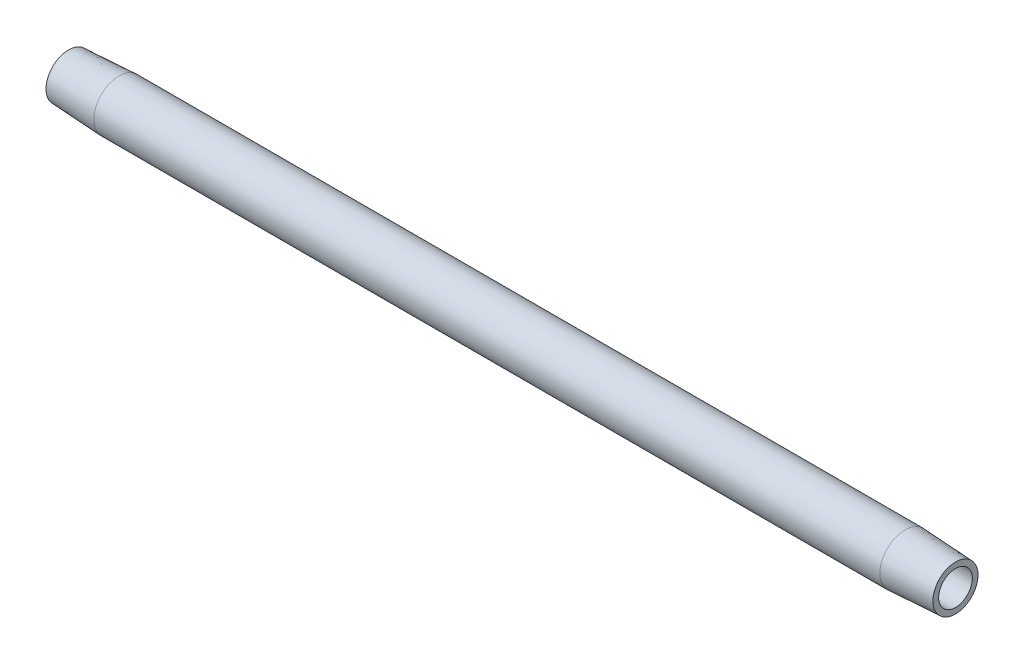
ISO-10303-21;
HEADER;
FILE_DESCRIPTION(('STEP AP214'),'2;1');
FILE_NAME('part.step','',(''),(''),'','','');
FILE_SCHEMA(('AUTOMOTIVE_DESIGN { 1 0 10303 214 1 1 1 1 }'));
ENDSEC;
DATA;
#1=APPLICATION_CONTEXT('core data for automotive mechanical design processes');
#2=APPLICATION_PROTOCOL_DEFINITION('international standard','automotive_design',2000,#1);
#3=PRODUCT_CONTEXT('',#1,'mechanical');
#4=PRODUCT('Part','Part','',(#3));
#5=PRODUCT_RELATED_PRODUCT_CATEGORY('part','',(#4));
#6=PRODUCT_DEFINITION_FORMATION('','',#4);
#7=PRODUCT_DEFINITION_CONTEXT('part definition',#1,'design');
#8=PRODUCT_DEFINITION('design','',#6,#7);
#9=PRODUCT_DEFINITION_SHAPE('','',#8);
#10=(LENGTH_UNIT() NAMED_UNIT(*) SI_UNIT(.MILLI.,.METRE.));
#11=(NAMED_UNIT(*) PLANE_ANGLE_UNIT() SI_UNIT($,.RADIAN.));
#12=(NAMED_UNIT(*) SI_UNIT($,.STERADIAN.) SOLID_ANGLE_UNIT());
#13=UNCERTAINTY_MEASURE_WITH_UNIT(LENGTH_MEASURE(1.E-05),#10,'distance_accuracy_value','');
#14=(GEOMETRIC_REPRESENTATION_CONTEXT(3) GLOBAL_UNCERTAINTY_ASSIGNED_CONTEXT((#13)) GLOBAL_UNIT_ASSIGNED_CONTEXT((#10,
#11,#12)) REPRESENTATION_CONTEXT('',''));
#15=CARTESIAN_POINT('',(0.,0.,0.));
#16=DIRECTION('',(0.,0.,1.));
#17=DIRECTION('',(1.,0.,0.));
#18=AXIS2_PLACEMENT_3D('',#15,#16,#17);
#19=CARTESIAN_POINT('',(0.476141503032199,0.,0.));
#20=DIRECTION('',(-1.,0.,0.));
#21=DIRECTION('',(0.,0.,1.));
#22=AXIS2_PLACEMENT_3D('',#19,#20,#21);
#23=CYLINDRICAL_SURFACE('',#22,3.96875);
#24=CARTESIAN_POINT('',(7.9375,0.,0.));
#25=DIRECTION('',(-1.,0.,0.));
#26=DIRECTION('',(0.,0.,1.));
#27=AXIS2_PLACEMENT_3D('',#24,#25,#26);
#28=CIRCLE('',#27,3.96875);
#29=CARTESIAN_POINT('',(7.9375,0.,3.96875));
#30=VERTEX_POINT('',#29);
#31=EDGE_CURVE('E10',#30,#30,#28,.T.);
#32=ORIENTED_EDGE('',*,*,#31,.F.);
#33=EDGE_LOOP('',(#32));
#34=FACE_BOUND('',#33,.T.);
#35=CARTESIAN_POINT('',(131.7625,0.,0.));
#36=DIRECTION('',(-1.,0.,0.));
#37=DIRECTION('',(0.,0.,1.));
#38=AXIS2_PLACEMENT_3D('',#35,#36,#37);
#39=CIRCLE('',#38,3.96875);
#40=CARTESIAN_POINT('',(131.7625,0.,3.96875));
#41=VERTEX_POINT('',#40);
#42=EDGE_CURVE('E52',#41,#41,#39,.T.);
#43=ORIENTED_EDGE('',*,*,#42,.T.);
#44=EDGE_LOOP('',(#43));
#45=FACE_BOUND('',#44,.T.);
#46=ADVANCED_FACE('F30',(#34,#45),#23,.T.);
#47=CARTESIAN_POINT('',(7.9375,0.,0.));
#48=DIRECTION('',(1.,0.,0.));
#49=DIRECTION('',(0.,0.,-1.));
#50=AXIS2_PLACEMENT_3D('',#47,#48,#49);
#51=CONICAL_SURFACE('',#50,3.96875,0.0523598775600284);
#52=CARTESIAN_POINT('',(0.,0.,0.));
#53=DIRECTION('',(-1.,0.,0.));
#54=DIRECTION('',(0.,0.,1.));
#55=AXIS2_PLACEMENT_3D('',#52,#53,#54);
#56=CIRCLE('',#55,3.55276325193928);
#57=CARTESIAN_POINT('',(0.,0.,3.55276325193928));
#58=VERTEX_POINT('',#57);
#59=EDGE_CURVE('E36',#58,#58,#56,.T.);
#60=ORIENTED_EDGE('',*,*,#59,.F.);
#61=EDGE_LOOP('',(#60));
#62=FACE_BOUND('',#61,.T.);
#63=ORIENTED_EDGE('',*,*,#31,.T.);
#64=EDGE_LOOP('',(#63));
#65=FACE_BOUND('',#64,.T.);
#66=ADVANCED_FACE('F77',(#62,#65),#51,.T.);
#67=CARTESIAN_POINT('',(0.,3.55276325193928,0.));
#68=DIRECTION('',(1.,0.,0.));
#69=DIRECTION('',(0.,0.,-1.));
#70=AXIS2_PLACEMENT_3D('',#67,#68,#69);
#71=PLANE('',#70);
#72=CARTESIAN_POINT('',(0.,0.,0.));
#73=DIRECTION('',(-1.,0.,0.));
#74=DIRECTION('',(0.,0.,1.));
#75=AXIS2_PLACEMENT_3D('',#72,#73,#74);
#76=CIRCLE('',#75,2.65429999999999);
#77=CARTESIAN_POINT('',(0.,0.,2.65429999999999));
#78=VERTEX_POINT('',#77);
#79=EDGE_CURVE('E40',#78,#78,#76,.T.);
#80=ORIENTED_EDGE('',*,*,#79,.F.);
#81=EDGE_LOOP('',(#80));
#82=FACE_BOUND('',#81,.T.);
#83=ORIENTED_EDGE('',*,*,#59,.T.);
#84=EDGE_LOOP('',(#83));
#85=FACE_BOUND('',#84,.T.);
#86=ADVANCED_FACE('F72',(#82,#85),#71,.F.);
#87=CARTESIAN_POINT('',(0.476141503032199,0.,0.));
#88=DIRECTION('',(-1.,0.,0.));
#89=DIRECTION('',(0.,0.,1.));
#90=AXIS2_PLACEMENT_3D('',#87,#88,#89);
#91=CYLINDRICAL_SURFACE('',#90,2.6543);
#92=CARTESIAN_POINT('',(139.7,0.,0.));
#93=DIRECTION('',(-1.,0.,0.));
#94=DIRECTION('',(0.,0.,1.));
#95=AXIS2_PLACEMENT_3D('',#92,#93,#94);
#96=CIRCLE('',#95,2.6543);
#97=CARTESIAN_POINT('',(139.7,0.,2.6543));
#98=VERTEX_POINT('',#97);
#99=EDGE_CURVE('E44',#98,#98,#96,.T.);
#100=ORIENTED_EDGE('',*,*,#99,.F.);
#101=EDGE_LOOP('',(#100));
#102=FACE_BOUND('',#101,.T.);
#103=ORIENTED_EDGE('',*,*,#79,.T.);
#104=EDGE_LOOP('',(#103));
#105=FACE_BOUND('',#104,.T.);
#106=ADVANCED_FACE('F66',(#102,#105),#91,.F.);
#107=CARTESIAN_POINT('',(139.7,2.6543,0.));
#108=DIRECTION('',(-1.,0.,0.));
#109=DIRECTION('',(0.,0.,1.));
#110=AXIS2_PLACEMENT_3D('',#107,#108,#109);
#111=PLANE('',#110);
#112=CARTESIAN_POINT('',(139.7,0.,0.));
#113=DIRECTION('',(-1.,0.,0.));
#114=DIRECTION('',(0.,0.,1.));
#115=AXIS2_PLACEMENT_3D('',#112,#113,#114);
#116=CIRCLE('',#115,3.55276325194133);
#117=CARTESIAN_POINT('',(139.7,0.,3.55276325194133));
#118=VERTEX_POINT('',#117);
#119=EDGE_CURVE('E49',#118,#118,#116,.T.);
#120=ORIENTED_EDGE('',*,*,#119,.F.);
#121=EDGE_LOOP('',(#120));
#122=FACE_BOUND('',#121,.T.);
#123=ORIENTED_EDGE('',*,*,#99,.T.);
#124=EDGE_LOOP('',(#123));
#125=FACE_BOUND('',#124,.T.);
#126=ADVANCED_FACE('F60',(#122,#125),#111,.F.);
#127=CARTESIAN_POINT('',(139.7,0.,0.));
#128=DIRECTION('',(-1.,0.,0.));
#129=DIRECTION('',(0.,0.,1.));
#130=AXIS2_PLACEMENT_3D('',#127,#128,#129);
#131=CONICAL_SURFACE('',#130,3.55276325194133,0.0523598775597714);
#132=ORIENTED_EDGE('',*,*,#42,.F.);
#133=EDGE_LOOP('',(#132));
#134=FACE_BOUND('',#133,.T.);
#135=ORIENTED_EDGE('',*,*,#119,.T.);
#136=EDGE_LOOP('',(#135));
#137=FACE_BOUND('',#136,.T.);
#138=ADVANCED_FACE('F57',(#134,#137),#131,.T.);
#139=CLOSED_SHELL('',(#46,#66,#86,#106,#126,#138));
#140=MANIFOLD_SOLID_BREP('B2',#139);
#141=ADVANCED_BREP_SHAPE_REPRESENTATION('',(#18,#140),#14);
#142=SHAPE_DEFINITION_REPRESENTATION(#9,#141);
ENDSEC;
END-ISO-10303-21;
